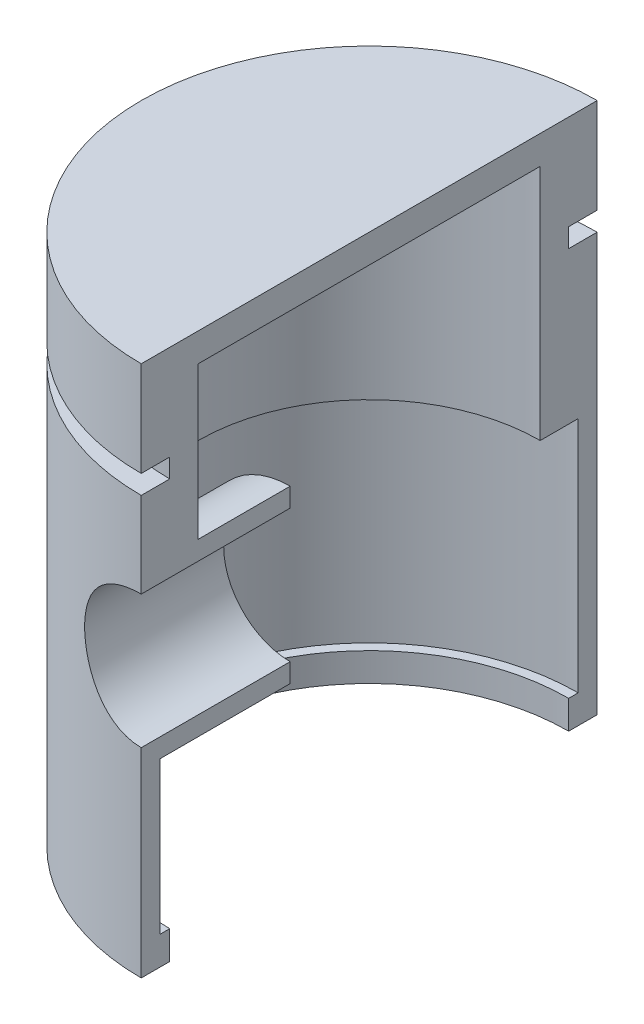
from build123d import *

# Parameters (mm, degrees)
MAIN_ANGLE          = 180
CIRCULAR_BOSS_REACH = 111.487
SKETCH6_R           = 11.1125
CIRCULAR_CUT_DEPTH  = 110.4866698
SKETCH7_W           = 4.7625
SKETCH7_H           = 3.175


with BuildPart() as part:
    # Sketch1 → Main (revolve)
    with BuildSketch(Plane(origin=(0, 0, 0), x_dir=(0, 0, -1), z_dir=(1, 0, 0))):
        Polygon((38.1, 88.9), (0, 88.9), (0, 84.1375), (28.575, 84.1375), (28.575, 44.45), (34.925, 44.45), (34.925, 4.7625), (33.3375, 4.7625), (33.3375, 0), (38.1, 0), align=None)
    revolve(axis=Axis((0, 88.9, 0), (0, 1, 0)), revolution_arc=MAIN_ANGLE)

    # Sketch5 → Circular Boss (add, up to next)
    with BuildSketch(Plane.XY.offset(13.208), mode=Mode.PRIVATE) as circular_boss_sk1:
        with BuildLine():
            Line((0, 30.1625), (0, 58.7375))
            ThreePointArc((0, 58.7375), (-14.2875, 44.45), (0, 30.1625))
        make_face()
    circular_boss_tool1 = extrude(circular_boss_sk1.sketch, amount=CIRCULAR_BOSS_REACH, mode=Mode.PRIVATE) - part.part
    add(circular_boss_tool1.solids().sort_by_distance((-6.063803, 44.45, 13.208))[0])

    # Sketch6 → Circular Cut (cut, through all)
    with BuildSketch(Plane.XY.offset(13.208)):
        with Locations((0, 44.45)):
            Circle(SKETCH6_R)
    extrude(amount=CIRCULAR_CUT_DEPTH, mode=Mode.SUBTRACT)

    # Sketch7 → Cut-Revolve1 (revolve, cut)
    with BuildSketch(Plane(origin=(0, 7.447290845, 55.242674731), x_dir=(0, 0, -1), z_dir=(1, 0, 0))):
        with Locations((90.961424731, 63.990209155)):
            Rectangle(SKETCH7_W, SKETCH7_H)
    revolve(axis=Axis((0, 73.025, 0), (0, -1, 0)), mode=Mode.SUBTRACT)


solid = part.part
